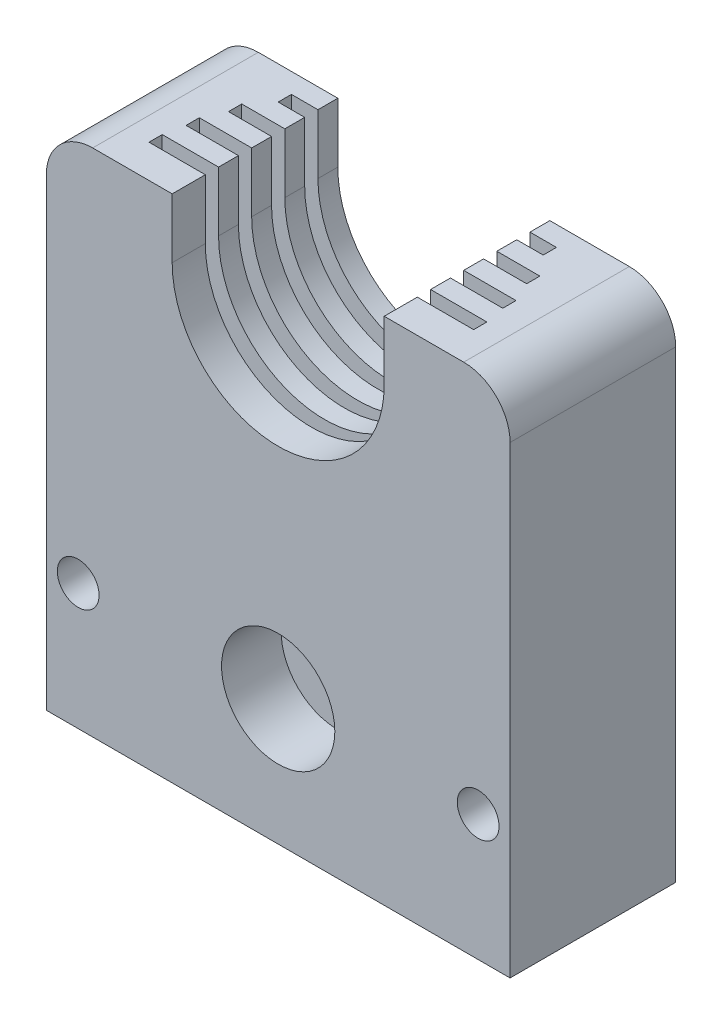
from build123d import *

# Parameters (mm, degrees)
SKETCH2_W               = 70
SKETCH2_H               = 70
BOSS_EXTRUDE1_DEPTH     = 25
FILLET1_R               = 7
FILLET2_R               = 7
CUT_EXTRUDE3_DEPTH      = 103.102889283
CUT_EXTRUDE3_DEPTH_BACK = 103.102889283
SKETCH4_R               = 3.15
CUT_EXTRUDE11_DEPTH     = 20
SKETCH20_R              = 8.55
CUT_EXTRUDE12_DEPTH     = 9
SKETCH21_W              = 70
SKETCH21_H              = 25
BOSS_EXTRUDE4_DEPTH     = 7
SKETCH23_W              = 47.8
SKETCH23_H              = 2
SKETCH23_W_2            = 49
SKETCH23_W_3            = 45
SKETCH23_W_4            = 40
CUT_EXTRUDE13_DEPTH     = 27


with BuildPart() as part:
    # Sketch2 → Boss-Extrude1 (new body)
    with BuildSketch(Plane.XY):
        with Locations((35, 35)):
            Rectangle(SKETCH2_W, SKETCH2_H)
    extrude(amount=BOSS_EXTRUDE1_DEPTH)

    # Fillet1
    fillet1_edges = [part.edges().sort_by_distance(p)[0] for p in [
        (70, 70, 12.5),
    ]]
    fillet(fillet1_edges, radius=FILLET1_R)

    # Fillet2
    fillet2_edges = [part.edges().sort_by_distance(p)[0] for p in [
        (0, 70, 12.5),
    ]]
    fillet(fillet2_edges, radius=FILLET2_R)

    # Sketch6 → Cut-Extrude3 (cut, two sides: drawn at the far end of the back side and taken through both)
    with BuildSketch(Plane.XY.offset(25).offset(-CUT_EXTRUDE3_DEPTH_BACK)):
        with BuildLine():
            Line((19, 253.216627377), (19, 70))
            Line((19, 70), (19, 61))
            ThreePointArc((19, 61), (35, 45), (51, 61))
            Line((51, 61), (51, 70))
            Line((51, 70), (51, 253.216627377))
            Line((51, 253.216627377), (51, 619.649882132))
            Line((51, 619.649882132), (19, 619.649882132))
            Line((19, 619.649882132), (19, 253.216627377))
        make_face()
    extrude(amount=CUT_EXTRUDE3_DEPTH + CUT_EXTRUDE3_DEPTH_BACK, mode=Mode.SUBTRACT)

    # Sketch4 → Cut-Extrude11 (cut)
    with BuildSketch(Plane.XY.offset(25)):
        with Locations((4.815, 12)):
            Circle(SKETCH4_R)
        with Locations((65.185, 12)):
            Circle(SKETCH4_R)
    extrude(amount=-CUT_EXTRUDE11_DEPTH, mode=Mode.SUBTRACT)

    # Sketch20 → Cut-Extrude12 (cut)
    with BuildSketch(Plane.XY.offset(25)):
        with Locations((35, 12)):
            Circle(SKETCH20_R)
    extrude(amount=-CUT_EXTRUDE12_DEPTH, mode=Mode.SUBTRACT)

    # Sketch21 → Boss-Extrude4 (add)
    with BuildSketch(Plane.XZ):
        with Locations((35, 12.5)):
            Rectangle(SKETCH21_W, SKETCH21_H)
    extrude(amount=BOSS_EXTRUDE4_DEPTH)

    # Sketch23 → Cut-Extrude13 (cut)
    with BuildSketch(Plane(origin=(0, 70, 0), x_dir=(1, 0, 0), z_dir=(0, 1, 0))):
        with Locations((35, -14)):
            Rectangle(SKETCH23_W, SKETCH23_H)
        with Locations((35, -19)):
            Rectangle(SKETCH23_W_2, SKETCH23_H)
        with Locations((35, -9)):
            Rectangle(SKETCH23_W_3, SKETCH23_H)
        with Locations((35, -4)):
            Rectangle(SKETCH23_W_4, SKETCH23_H)
    extrude(amount=-CUT_EXTRUDE13_DEPTH, mode=Mode.SUBTRACT)


solid = part.part
